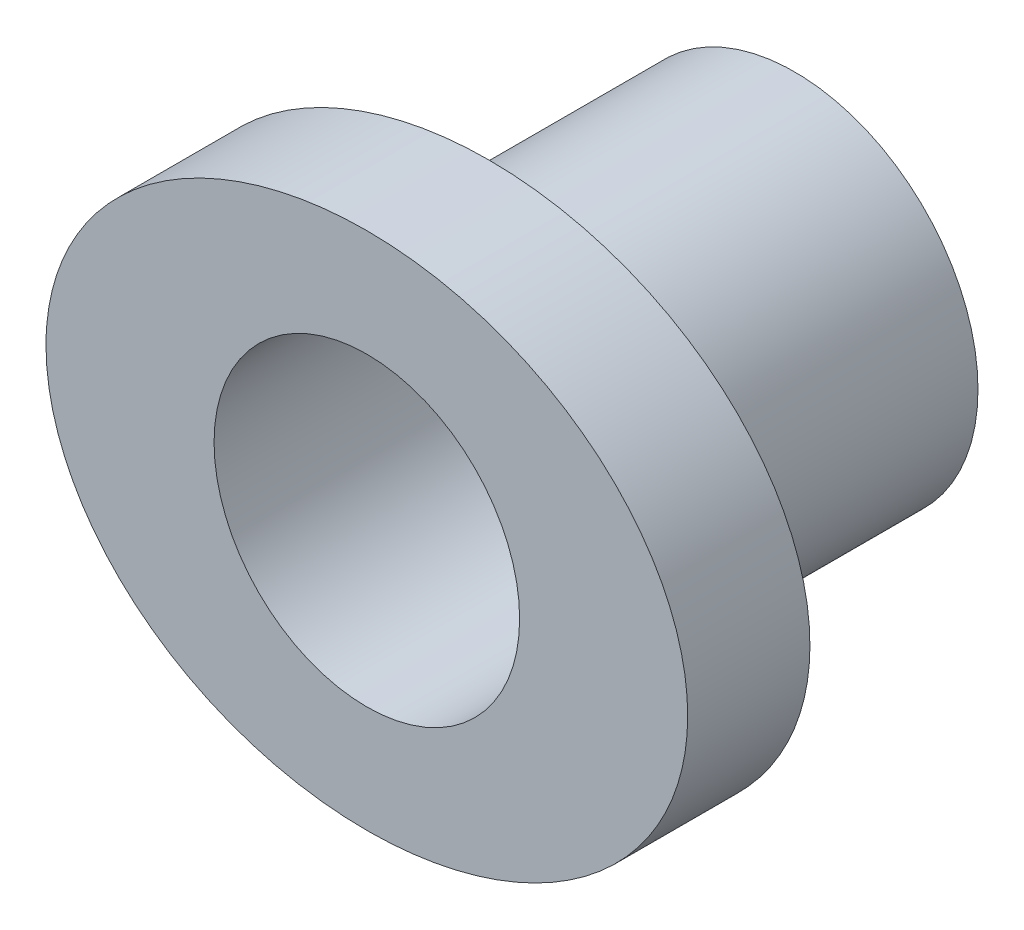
ISO-10303-21;
HEADER;
FILE_DESCRIPTION(('STEP AP214'),'2;1');
FILE_NAME('part.step','',(''),(''),'','','');
FILE_SCHEMA(('AUTOMOTIVE_DESIGN { 1 0 10303 214 1 1 1 1 }'));
ENDSEC;
DATA;
#1=APPLICATION_CONTEXT('core data for automotive mechanical design processes');
#2=APPLICATION_PROTOCOL_DEFINITION('international standard','automotive_design',2000,#1);
#3=PRODUCT_CONTEXT('',#1,'mechanical');
#4=PRODUCT('Part','Part','',(#3));
#5=PRODUCT_RELATED_PRODUCT_CATEGORY('part','',(#4));
#6=PRODUCT_DEFINITION_FORMATION('','',#4);
#7=PRODUCT_DEFINITION_CONTEXT('part definition',#1,'design');
#8=PRODUCT_DEFINITION('design','',#6,#7);
#9=PRODUCT_DEFINITION_SHAPE('','',#8);
#10=(LENGTH_UNIT() NAMED_UNIT(*) SI_UNIT(.MILLI.,.METRE.));
#11=(NAMED_UNIT(*) PLANE_ANGLE_UNIT() SI_UNIT($,.RADIAN.));
#12=(NAMED_UNIT(*) SI_UNIT($,.STERADIAN.) SOLID_ANGLE_UNIT());
#13=UNCERTAINTY_MEASURE_WITH_UNIT(LENGTH_MEASURE(1.E-05),#10,'distance_accuracy_value','');
#14=(GEOMETRIC_REPRESENTATION_CONTEXT(3) GLOBAL_UNCERTAINTY_ASSIGNED_CONTEXT((#13)) GLOBAL_UNIT_ASSIGNED_CONTEXT((#10,
#11,#12)) REPRESENTATION_CONTEXT('',''));
#15=CARTESIAN_POINT('',(0.,0.,0.));
#16=DIRECTION('',(0.,0.,1.));
#17=DIRECTION('',(1.,0.,0.));
#18=AXIS2_PLACEMENT_3D('',#15,#16,#17);
#19=CARTESIAN_POINT('',(0.,0.,0.));
#20=DIRECTION('',(0.,0.,1.));
#21=DIRECTION('',(1.,0.,0.));
#22=AXIS2_PLACEMENT_3D('',#19,#20,#21);
#23=PLANE('',#22);
#24=CARTESIAN_POINT('',(0.,0.,0.));
#25=DIRECTION('',(0.,0.,1.));
#26=DIRECTION('',(-1.,0.,0.));
#27=AXIS2_PLACEMENT_3D('',#24,#25,#26);
#28=ELLIPSE('',#27,5.25,4.25);
#29=CARTESIAN_POINT('',(-5.25,0.,0.));
#30=VERTEX_POINT('',#29);
#31=EDGE_CURVE('E43',#30,#30,#28,.T.);
#32=ORIENTED_EDGE('',*,*,#31,.F.);
#33=EDGE_LOOP('',(#32));
#34=FACE_BOUND('',#33,.T.);
#35=CARTESIAN_POINT('',(0.,0.,0.));
#36=DIRECTION('',(0.,0.,1.));
#37=DIRECTION('',(1.,0.,0.));
#38=AXIS2_PLACEMENT_3D('',#35,#36,#37);
#39=CIRCLE('',#38,3.);
#40=CARTESIAN_POINT('',(3.,0.,0.));
#41=VERTEX_POINT('',#40);
#42=EDGE_CURVE('E10',#41,#41,#39,.F.);
#43=ORIENTED_EDGE('',*,*,#42,.F.);
#44=EDGE_LOOP('',(#43));
#45=FACE_BOUND('',#44,.T.);
#46=ADVANCED_FACE('F31',(#34,#45),#23,.F.);
#47=CARTESIAN_POINT('',(0.,0.,2.));
#48=DIRECTION('',(0.,0.,1.));
#49=DIRECTION('',(1.,0.,0.));
#50=AXIS2_PLACEMENT_3D('',#47,#48,#49);
#51=PLANE('',#50);
#52=CARTESIAN_POINT('',(0.,0.,2.));
#53=DIRECTION('',(0.,0.,1.));
#54=DIRECTION('',(-1.,0.,0.));
#55=AXIS2_PLACEMENT_3D('',#52,#53,#54);
#56=ELLIPSE('',#55,5.25,4.25);
#57=CARTESIAN_POINT('',(-5.25,0.,2.));
#58=VERTEX_POINT('',#57);
#59=EDGE_CURVE('E39',#58,#58,#56,.T.);
#60=ORIENTED_EDGE('',*,*,#59,.T.);
#61=EDGE_LOOP('',(#60));
#62=FACE_BOUND('',#61,.T.);
#63=CARTESIAN_POINT('',(0.,0.,2.));
#64=DIRECTION('',(0.,0.,1.));
#65=DIRECTION('',(1.,0.,0.));
#66=AXIS2_PLACEMENT_3D('',#63,#64,#65);
#67=CIRCLE('',#66,2.5);
#68=CARTESIAN_POINT('',(2.5,0.,2.));
#69=VERTEX_POINT('',#68);
#70=EDGE_CURVE('E47',#69,#69,#67,.T.);
#71=ORIENTED_EDGE('',*,*,#70,.F.);
#72=EDGE_LOOP('',(#71));
#73=FACE_BOUND('',#72,.T.);
#74=ADVANCED_FACE('F75',(#62,#73),#51,.T.);
#75=DIRECTION('',(0.,0.,-1.));
#76=VECTOR('',#75,1.);
#77=SURFACE_OF_LINEAR_EXTRUSION('',#56,#76);
#78=ORIENTED_EDGE('',*,*,#59,.F.);
#79=EDGE_LOOP('',(#78));
#80=FACE_BOUND('',#79,.T.);
#81=ORIENTED_EDGE('',*,*,#31,.T.);
#82=EDGE_LOOP('',(#81));
#83=FACE_BOUND('',#82,.T.);
#84=ADVANCED_FACE('F33',(#80,#83),#77,.F.);
#85=CARTESIAN_POINT('',(0.,0.,2.));
#86=DIRECTION('',(0.,0.,-1.));
#87=DIRECTION('',(-1.,0.,0.));
#88=AXIS2_PLACEMENT_3D('',#85,#86,#87);
#89=CYLINDRICAL_SURFACE('',#88,2.5);
#90=ORIENTED_EDGE('',*,*,#70,.T.);
#91=EDGE_LOOP('',(#90));
#92=FACE_BOUND('',#91,.T.);
#93=CARTESIAN_POINT('',(0.,0.,-5.));
#94=DIRECTION('',(0.,0.,-1.));
#95=DIRECTION('',(-1.,0.,0.));
#96=AXIS2_PLACEMENT_3D('',#93,#94,#95);
#97=CIRCLE('',#96,2.5);
#98=CARTESIAN_POINT('',(-2.5,0.,-5.));
#99=VERTEX_POINT('',#98);
#100=EDGE_CURVE('E55',#99,#99,#97,.T.);
#101=ORIENTED_EDGE('',*,*,#100,.T.);
#102=EDGE_LOOP('',(#101));
#103=FACE_BOUND('',#102,.T.);
#104=ADVANCED_FACE('F59',(#92,#103),#89,.F.);
#105=CARTESIAN_POINT('',(0.,0.,-5.));
#106=DIRECTION('',(0.,0.,-1.));
#107=DIRECTION('',(-1.,0.,0.));
#108=AXIS2_PLACEMENT_3D('',#105,#106,#107);
#109=PLANE('',#108);
#110=CARTESIAN_POINT('',(0.,0.,-5.));
#111=DIRECTION('',(0.,0.,-1.));
#112=DIRECTION('',(-1.,0.,0.));
#113=AXIS2_PLACEMENT_3D('',#110,#111,#112);
#114=CIRCLE('',#113,3.);
#115=CARTESIAN_POINT('',(-3.,0.,-5.));
#116=VERTEX_POINT('',#115);
#117=EDGE_CURVE('E52',#116,#116,#114,.T.);
#118=ORIENTED_EDGE('',*,*,#117,.T.);
#119=EDGE_LOOP('',(#118));
#120=FACE_BOUND('',#119,.T.);
#121=ORIENTED_EDGE('',*,*,#100,.F.);
#122=EDGE_LOOP('',(#121));
#123=FACE_BOUND('',#122,.T.);
#124=ADVANCED_FACE('F61',(#120,#123),#109,.T.);
#125=CARTESIAN_POINT('',(0.,0.,-5.));
#126=DIRECTION('',(0.,0.,1.));
#127=DIRECTION('',(1.,0.,0.));
#128=AXIS2_PLACEMENT_3D('',#125,#126,#127);
#129=CYLINDRICAL_SURFACE('',#128,3.);
#130=ORIENTED_EDGE('',*,*,#117,.F.);
#131=EDGE_LOOP('',(#130));
#132=FACE_BOUND('',#131,.T.);
#133=ORIENTED_EDGE('',*,*,#42,.T.);
#134=EDGE_LOOP('',(#133));
#135=FACE_BOUND('',#134,.T.);
#136=ADVANCED_FACE('F63',(#132,#135),#129,.T.);
#137=CLOSED_SHELL('',(#46,#74,#84,#104,#124,#136));
#138=MANIFOLD_SOLID_BREP('B2',#137);
#139=ADVANCED_BREP_SHAPE_REPRESENTATION('',(#18,#138),#14);
#140=SHAPE_DEFINITION_REPRESENTATION(#9,#139);
ENDSEC;
END-ISO-10303-21;
